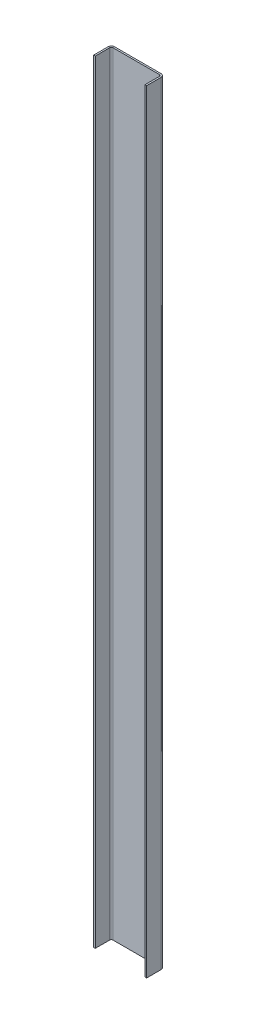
ISO-10303-21;
HEADER;
FILE_DESCRIPTION(('STEP AP214'),'2;1');
FILE_NAME('part.step','',(''),(''),'','','');
FILE_SCHEMA(('AUTOMOTIVE_DESIGN { 1 0 10303 214 1 1 1 1 }'));
ENDSEC;
DATA;
#1=APPLICATION_CONTEXT('core data for automotive mechanical design processes');
#2=APPLICATION_PROTOCOL_DEFINITION('international standard','automotive_design',2000,#1);
#3=PRODUCT_CONTEXT('',#1,'mechanical');
#4=PRODUCT('Part','Part','',(#3));
#5=PRODUCT_RELATED_PRODUCT_CATEGORY('part','',(#4));
#6=PRODUCT_DEFINITION_FORMATION('','',#4);
#7=PRODUCT_DEFINITION_CONTEXT('part definition',#1,'design');
#8=PRODUCT_DEFINITION('design','',#6,#7);
#9=PRODUCT_DEFINITION_SHAPE('','',#8);
#10=(LENGTH_UNIT() NAMED_UNIT(*) SI_UNIT(.MILLI.,.METRE.));
#11=(NAMED_UNIT(*) PLANE_ANGLE_UNIT() SI_UNIT($,.RADIAN.));
#12=(NAMED_UNIT(*) SI_UNIT($,.STERADIAN.) SOLID_ANGLE_UNIT());
#13=UNCERTAINTY_MEASURE_WITH_UNIT(LENGTH_MEASURE(1.E-05),#10,'distance_accuracy_value','');
#14=(GEOMETRIC_REPRESENTATION_CONTEXT(3) GLOBAL_UNCERTAINTY_ASSIGNED_CONTEXT((#13)) GLOBAL_UNIT_ASSIGNED_CONTEXT((#10,
#11,#12)) REPRESENTATION_CONTEXT('',''));
#15=CARTESIAN_POINT('',(0.,0.,0.));
#16=DIRECTION('',(0.,0.,1.));
#17=DIRECTION('',(1.,0.,0.));
#18=AXIS2_PLACEMENT_3D('',#15,#16,#17);
#19=CARTESIAN_POINT('',(-66.675,2222.5,0.));
#20=DIRECTION('',(0.,1.,0.));
#21=DIRECTION('',(0.,0.,1.));
#22=AXIS2_PLACEMENT_3D('',#19,#20,#21);
#23=PLANE('',#22);
#24=DIRECTION('',(0.,0.,1.));
#25=VECTOR('',#24,1.);
#26=CARTESIAN_POINT('',(-66.675,2222.5,0.));
#27=LINE('',#26,#25);
#28=CARTESIAN_POINT('',(-66.675,2222.5,0.));
#29=VERTEX_POINT('',#28);
#30=CARTESIAN_POINT('',(-66.675,2222.5,4.7625));
#31=VERTEX_POINT('',#30);
#32=EDGE_CURVE('E11',#29,#31,#27,.T.);
#33=ORIENTED_EDGE('',*,*,#32,.F.);
#34=CARTESIAN_POINT('',(-66.675,2222.5,9.525));
#35=DIRECTION('',(0.,1.,0.));
#36=DIRECTION('',(0.,0.,1.));
#37=AXIS2_PLACEMENT_3D('',#34,#35,#36);
#38=CIRCLE('',#37,9.525);
#39=CARTESIAN_POINT('',(-76.2,2222.5,9.525));
#40=VERTEX_POINT('',#39);
#41=EDGE_CURVE('E247',#40,#29,#38,.F.);
#42=ORIENTED_EDGE('',*,*,#41,.F.);
#43=DIRECTION('',(-1.,0.,0.));
#44=VECTOR('',#43,1.);
#45=CARTESIAN_POINT('',(-71.4375,2222.5,9.525));
#46=LINE('',#45,#44);
#47=CARTESIAN_POINT('',(-71.4375,2222.5,9.525));
#48=VERTEX_POINT('',#47);
#49=EDGE_CURVE('E45',#48,#40,#46,.T.);
#50=ORIENTED_EDGE('',*,*,#49,.F.);
#51=CARTESIAN_POINT('',(-66.675,2222.5,9.525));
#52=DIRECTION('',(0.,1.,0.));
#53=DIRECTION('',(1.,0.,0.));
#54=AXIS2_PLACEMENT_3D('',#51,#52,#53);
#55=CIRCLE('',#54,4.7625);
#56=EDGE_CURVE('E146',#48,#31,#55,.F.);
#57=ORIENTED_EDGE('',*,*,#56,.T.);
#58=EDGE_LOOP('',(#33,#42,#50,#57));
#59=FACE_BOUND('',#58,.T.);
#60=ADVANCED_FACE('F37',(#59),#23,.T.);
#61=CARTESIAN_POINT('',(-71.4375,2222.5,9.525));
#62=DIRECTION('',(0.,1.,0.));
#63=DIRECTION('',(0.,0.,1.));
#64=AXIS2_PLACEMENT_3D('',#61,#62,#63);
#65=PLANE('',#64);
#66=DIRECTION('',(1.,0.,0.));
#67=VECTOR('',#66,1.);
#68=CARTESIAN_POINT('',(-76.2,2222.5,0.));
#69=LINE('',#68,#67);
#70=CARTESIAN_POINT('',(66.6749999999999,2222.5,0.));
#71=VERTEX_POINT('',#70);
#72=EDGE_CURVE('E140',#29,#71,#69,.T.);
#73=ORIENTED_EDGE('',*,*,#72,.F.);
#74=ORIENTED_EDGE('',*,*,#32,.T.);
#75=DIRECTION('',(1.,0.,0.));
#76=VECTOR('',#75,1.);
#77=CARTESIAN_POINT('',(-76.2,2222.5,4.7625));
#78=LINE('',#77,#76);
#79=CARTESIAN_POINT('',(66.6749999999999,2222.5,4.7625));
#80=VERTEX_POINT('',#79);
#81=EDGE_CURVE('E137',#31,#80,#78,.T.);
#82=ORIENTED_EDGE('',*,*,#81,.T.);
#83=DIRECTION('',(0.,0.,-1.));
#84=VECTOR('',#83,1.);
#85=CARTESIAN_POINT('',(66.6749999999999,2222.5,4.7625));
#86=LINE('',#85,#84);
#87=EDGE_CURVE('E228',#80,#71,#86,.T.);
#88=ORIENTED_EDGE('',*,*,#87,.T.);
#89=EDGE_LOOP('',(#73,#74,#82,#88));
#90=FACE_BOUND('',#89,.T.);
#91=ADVANCED_FACE('F135',(#90),#65,.T.);
#92=CARTESIAN_POINT('',(-76.2,0.,9.525));
#93=DIRECTION('',(0.,-1.,0.));
#94=DIRECTION('',(0.,0.,-1.));
#95=AXIS2_PLACEMENT_3D('',#92,#93,#94);
#96=PLANE('',#95);
#97=DIRECTION('',(1.,0.,0.));
#98=VECTOR('',#97,1.);
#99=CARTESIAN_POINT('',(-76.2,0.,9.525));
#100=LINE('',#99,#98);
#101=CARTESIAN_POINT('',(-76.2,0.,9.525));
#102=VERTEX_POINT('',#101);
#103=CARTESIAN_POINT('',(-71.4375,0.,9.525));
#104=VERTEX_POINT('',#103);
#105=EDGE_CURVE('E233',#102,#104,#100,.T.);
#106=ORIENTED_EDGE('',*,*,#105,.F.);
#107=CARTESIAN_POINT('',(-66.675,0.,9.525));
#108=DIRECTION('',(0.,1.,0.));
#109=DIRECTION('',(0.,0.,1.));
#110=AXIS2_PLACEMENT_3D('',#107,#108,#109);
#111=CIRCLE('',#110,9.525);
#112=CARTESIAN_POINT('',(-66.675,0.,0.));
#113=VERTEX_POINT('',#112);
#114=EDGE_CURVE('E185',#102,#113,#111,.F.);
#115=ORIENTED_EDGE('',*,*,#114,.T.);
#116=DIRECTION('',(0.,0.,-1.));
#117=VECTOR('',#116,1.);
#118=CARTESIAN_POINT('',(-66.675,0.,4.7625));
#119=LINE('',#118,#117);
#120=CARTESIAN_POINT('',(-66.675,0.,4.7625));
#121=VERTEX_POINT('',#120);
#122=EDGE_CURVE('E231',#121,#113,#119,.T.);
#123=ORIENTED_EDGE('',*,*,#122,.F.);
#124=CARTESIAN_POINT('',(-66.675,0.,9.525));
#125=DIRECTION('',(0.,1.,0.));
#126=DIRECTION('',(1.,0.,0.));
#127=AXIS2_PLACEMENT_3D('',#124,#125,#126);
#128=CIRCLE('',#127,4.7625);
#129=EDGE_CURVE('E158',#104,#121,#128,.F.);
#130=ORIENTED_EDGE('',*,*,#129,.F.);
#131=EDGE_LOOP('',(#106,#115,#123,#130));
#132=FACE_BOUND('',#131,.T.);
#133=ADVANCED_FACE('F285',(#132),#96,.T.);
#134=CARTESIAN_POINT('',(-66.675,0.,4.7625));
#135=DIRECTION('',(0.,-1.,0.));
#136=DIRECTION('',(0.,0.,-1.));
#137=AXIS2_PLACEMENT_3D('',#134,#135,#136);
#138=PLANE('',#137);
#139=DIRECTION('',(0.,0.,-1.));
#140=VECTOR('',#139,1.);
#141=CARTESIAN_POINT('',(-76.2,0.,0.));
#142=LINE('',#141,#140);
#143=CARTESIAN_POINT('',(-76.2,0.,50.8));
#144=VERTEX_POINT('',#143);
#145=EDGE_CURVE('E188',#144,#102,#142,.T.);
#146=ORIENTED_EDGE('',*,*,#145,.T.);
#147=ORIENTED_EDGE('',*,*,#105,.T.);
#148=DIRECTION('',(0.,0.,-1.));
#149=VECTOR('',#148,1.);
#150=CARTESIAN_POINT('',(-71.4375,0.,0.));
#151=LINE('',#150,#149);
#152=CARTESIAN_POINT('',(-71.4375,0.,50.8));
#153=VERTEX_POINT('',#152);
#154=EDGE_CURVE('E194',#153,#104,#151,.T.);
#155=ORIENTED_EDGE('',*,*,#154,.F.);
#156=DIRECTION('',(-1.,0.,0.));
#157=VECTOR('',#156,1.);
#158=CARTESIAN_POINT('',(-71.4375,0.,50.8));
#159=LINE('',#158,#157);
#160=EDGE_CURVE('E191',#153,#144,#159,.T.);
#161=ORIENTED_EDGE('',*,*,#160,.T.);
#162=EDGE_LOOP('',(#146,#147,#155,#161));
#163=FACE_BOUND('',#162,.T.);
#164=ADVANCED_FACE('F288',(#163),#138,.T.);
#165=CARTESIAN_POINT('',(76.2,2222.5,9.52500000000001));
#166=DIRECTION('',(0.,1.,0.));
#167=DIRECTION('',(0.,0.,1.));
#168=AXIS2_PLACEMENT_3D('',#165,#166,#167);
#169=PLANE('',#168);
#170=DIRECTION('',(-1.,0.,0.));
#171=VECTOR('',#170,1.);
#172=CARTESIAN_POINT('',(76.2,2222.5,9.52500000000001));
#173=LINE('',#172,#171);
#174=CARTESIAN_POINT('',(76.2,2222.5,9.52500000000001));
#175=VERTEX_POINT('',#174);
#176=CARTESIAN_POINT('',(71.4375,2222.5,9.525));
#177=VERTEX_POINT('',#176);
#178=EDGE_CURVE('E53',#175,#177,#173,.T.);
#179=ORIENTED_EDGE('',*,*,#178,.F.);
#180=CARTESIAN_POINT('',(66.675,2222.5,9.525));
#181=DIRECTION('',(0.,1.,0.));
#182=DIRECTION('',(0.,0.,1.));
#183=AXIS2_PLACEMENT_3D('',#180,#181,#182);
#184=CIRCLE('',#183,9.525);
#185=EDGE_CURVE('E257',#71,#175,#184,.F.);
#186=ORIENTED_EDGE('',*,*,#185,.F.);
#187=ORIENTED_EDGE('',*,*,#87,.F.);
#188=CARTESIAN_POINT('',(66.675,2222.5,9.525));
#189=DIRECTION('',(0.,1.,0.));
#190=DIRECTION('',(1.,0.,0.));
#191=AXIS2_PLACEMENT_3D('',#188,#189,#190);
#192=CIRCLE('',#191,4.7625);
#193=EDGE_CURVE('E166',#80,#177,#192,.F.);
#194=ORIENTED_EDGE('',*,*,#193,.T.);
#195=EDGE_LOOP('',(#179,#186,#187,#194));
#196=FACE_BOUND('',#195,.T.);
#197=ADVANCED_FACE('F280',(#196),#169,.T.);
#198=CARTESIAN_POINT('',(66.6749999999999,2222.5,4.7625));
#199=DIRECTION('',(0.,1.,0.));
#200=DIRECTION('',(0.,0.,1.));
#201=AXIS2_PLACEMENT_3D('',#198,#199,#200);
#202=PLANE('',#201);
#203=DIRECTION('',(0.,0.,1.));
#204=VECTOR('',#203,1.);
#205=CARTESIAN_POINT('',(76.2,2222.5,0.));
#206=LINE('',#205,#204);
#207=CARTESIAN_POINT('',(76.2,2222.5,50.8));
#208=VERTEX_POINT('',#207);
#209=EDGE_CURVE('E260',#175,#208,#206,.T.);
#210=ORIENTED_EDGE('',*,*,#209,.F.);
#211=ORIENTED_EDGE('',*,*,#178,.T.);
#212=DIRECTION('',(0.,0.,1.));
#213=VECTOR('',#212,1.);
#214=CARTESIAN_POINT('',(71.4375,2222.5,0.));
#215=LINE('',#214,#213);
#216=CARTESIAN_POINT('',(71.4375,2222.5,50.8));
#217=VERTEX_POINT('',#216);
#218=EDGE_CURVE('E107',#177,#217,#215,.T.);
#219=ORIENTED_EDGE('',*,*,#218,.T.);
#220=DIRECTION('',(-1.,0.,0.));
#221=VECTOR('',#220,1.);
#222=CARTESIAN_POINT('',(76.2,2222.5,50.8));
#223=LINE('',#222,#221);
#224=EDGE_CURVE('E263',#208,#217,#223,.T.);
#225=ORIENTED_EDGE('',*,*,#224,.F.);
#226=EDGE_LOOP('',(#210,#211,#219,#225));
#227=FACE_BOUND('',#226,.T.);
#228=ADVANCED_FACE('F269',(#227),#202,.T.);
#229=CARTESIAN_POINT('',(66.6749999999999,0.,0.));
#230=DIRECTION('',(0.,-1.,0.));
#231=DIRECTION('',(0.,0.,-1.));
#232=AXIS2_PLACEMENT_3D('',#229,#230,#231);
#233=PLANE('',#232);
#234=DIRECTION('',(0.,0.,1.));
#235=VECTOR('',#234,1.);
#236=CARTESIAN_POINT('',(66.6749999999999,0.,0.));
#237=LINE('',#236,#235);
#238=CARTESIAN_POINT('',(66.6749999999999,0.,0.));
#239=VERTEX_POINT('',#238);
#240=CARTESIAN_POINT('',(66.6749999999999,0.,4.7625));
#241=VERTEX_POINT('',#240);
#242=EDGE_CURVE('E94',#239,#241,#237,.T.);
#243=ORIENTED_EDGE('',*,*,#242,.F.);
#244=CARTESIAN_POINT('',(66.675,0.,9.525));
#245=DIRECTION('',(0.,1.,0.));
#246=DIRECTION('',(0.,0.,1.));
#247=AXIS2_PLACEMENT_3D('',#244,#245,#246);
#248=CIRCLE('',#247,9.525);
#249=CARTESIAN_POINT('',(76.2,0.,9.52500000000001));
#250=VERTEX_POINT('',#249);
#251=EDGE_CURVE('E181',#239,#250,#248,.F.);
#252=ORIENTED_EDGE('',*,*,#251,.T.);
#253=DIRECTION('',(1.,0.,0.));
#254=VECTOR('',#253,1.);
#255=CARTESIAN_POINT('',(71.4375,0.,9.525));
#256=LINE('',#255,#254);
#257=CARTESIAN_POINT('',(71.4375,0.,9.525));
#258=VERTEX_POINT('',#257);
#259=EDGE_CURVE('E101',#258,#250,#256,.T.);
#260=ORIENTED_EDGE('',*,*,#259,.F.);
#261=CARTESIAN_POINT('',(66.675,0.,9.525));
#262=DIRECTION('',(0.,1.,0.));
#263=DIRECTION('',(1.,0.,0.));
#264=AXIS2_PLACEMENT_3D('',#261,#262,#263);
#265=CIRCLE('',#264,4.7625);
#266=EDGE_CURVE('E200',#241,#258,#265,.F.);
#267=ORIENTED_EDGE('',*,*,#266,.F.);
#268=EDGE_LOOP('',(#243,#252,#260,#267));
#269=FACE_BOUND('',#268,.T.);
#270=ADVANCED_FACE('F317',(#269),#233,.T.);
#271=CARTESIAN_POINT('',(71.4375,0.,9.525));
#272=DIRECTION('',(0.,-1.,0.));
#273=DIRECTION('',(0.,0.,-1.));
#274=AXIS2_PLACEMENT_3D('',#271,#272,#273);
#275=PLANE('',#274);
#276=DIRECTION('',(1.,0.,0.));
#277=VECTOR('',#276,1.);
#278=CARTESIAN_POINT('',(-76.2,0.,0.));
#279=LINE('',#278,#277);
#280=EDGE_CURVE('E183',#113,#239,#279,.T.);
#281=ORIENTED_EDGE('',*,*,#280,.T.);
#282=ORIENTED_EDGE('',*,*,#242,.T.);
#283=DIRECTION('',(1.,0.,0.));
#284=VECTOR('',#283,1.);
#285=CARTESIAN_POINT('',(-76.2,0.,4.7625));
#286=LINE('',#285,#284);
#287=EDGE_CURVE('E198',#121,#241,#286,.T.);
#288=ORIENTED_EDGE('',*,*,#287,.F.);
#289=ORIENTED_EDGE('',*,*,#122,.T.);
#290=EDGE_LOOP('',(#281,#282,#288,#289));
#291=FACE_BOUND('',#290,.T.);
#292=ADVANCED_FACE('F320',(#291),#275,.T.);
#293=CARTESIAN_POINT('',(71.4375,2222.5,0.));
#294=DIRECTION('',(1.,0.,0.));
#295=DIRECTION('',(0.,0.,-1.));
#296=AXIS2_PLACEMENT_3D('',#293,#294,#295);
#297=PLANE('',#296);
#298=DIRECTION('',(0.,0.,1.));
#299=VECTOR('',#298,1.);
#300=CARTESIAN_POINT('',(71.4375,0.,0.));
#301=LINE('',#300,#299);
#302=CARTESIAN_POINT('',(71.4375,0.,50.8));
#303=VERTEX_POINT('',#302);
#304=EDGE_CURVE('E172',#258,#303,#301,.T.);
#305=ORIENTED_EDGE('',*,*,#304,.T.);
#306=DIRECTION('',(0.,-1.,0.));
#307=VECTOR('',#306,1.);
#308=CARTESIAN_POINT('',(71.4375,2222.5,50.8));
#309=LINE('',#308,#307);
#310=EDGE_CURVE('E224',#217,#303,#309,.T.);
#311=ORIENTED_EDGE('',*,*,#310,.F.);
#312=ORIENTED_EDGE('',*,*,#218,.F.);
#313=DIRECTION('',(0.,-1.,0.));
#314=VECTOR('',#313,1.);
#315=CARTESIAN_POINT('',(71.4375,2222.5,9.525));
#316=LINE('',#315,#314);
#317=EDGE_CURVE('E168',#177,#258,#316,.T.);
#318=ORIENTED_EDGE('',*,*,#317,.T.);
#319=EDGE_LOOP('',(#305,#311,#312,#318));
#320=FACE_BOUND('',#319,.T.);
#321=ADVANCED_FACE('F323',(#320),#297,.F.);
#322=CARTESIAN_POINT('',(76.2,2222.5,50.8));
#323=DIRECTION('',(0.,0.,1.));
#324=DIRECTION('',(1.,0.,0.));
#325=AXIS2_PLACEMENT_3D('',#322,#323,#324);
#326=PLANE('',#325);
#327=DIRECTION('',(-1.,0.,0.));
#328=VECTOR('',#327,1.);
#329=CARTESIAN_POINT('',(76.2,0.,50.8));
#330=LINE('',#329,#328);
#331=CARTESIAN_POINT('',(76.2,0.,50.8));
#332=VERTEX_POINT('',#331);
#333=EDGE_CURVE('E175',#332,#303,#330,.T.);
#334=ORIENTED_EDGE('',*,*,#333,.F.);
#335=DIRECTION('',(0.,-1.,0.));
#336=VECTOR('',#335,1.);
#337=CARTESIAN_POINT('',(76.2,2222.5,50.8));
#338=LINE('',#337,#336);
#339=EDGE_CURVE('E222',#208,#332,#338,.T.);
#340=ORIENTED_EDGE('',*,*,#339,.F.);
#341=ORIENTED_EDGE('',*,*,#224,.T.);
#342=ORIENTED_EDGE('',*,*,#310,.T.);
#343=EDGE_LOOP('',(#334,#340,#341,#342));
#344=FACE_BOUND('',#343,.T.);
#345=ADVANCED_FACE('F268',(#344),#326,.T.);
#346=CARTESIAN_POINT('',(76.2,2222.5,0.));
#347=DIRECTION('',(1.,0.,0.));
#348=DIRECTION('',(0.,0.,-1.));
#349=AXIS2_PLACEMENT_3D('',#346,#347,#348);
#350=PLANE('',#349);
#351=DIRECTION('',(0.,0.,1.));
#352=VECTOR('',#351,1.);
#353=CARTESIAN_POINT('',(76.2,0.,0.));
#354=LINE('',#353,#352);
#355=EDGE_CURVE('E178',#250,#332,#354,.T.);
#356=ORIENTED_EDGE('',*,*,#355,.F.);
#357=DIRECTION('',(0.,-1.,0.));
#358=VECTOR('',#357,1.);
#359=CARTESIAN_POINT('',(76.2,2222.5,9.52500000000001));
#360=LINE('',#359,#358);
#361=EDGE_CURVE('E219',#175,#250,#360,.T.);
#362=ORIENTED_EDGE('',*,*,#361,.F.);
#363=ORIENTED_EDGE('',*,*,#209,.T.);
#364=ORIENTED_EDGE('',*,*,#339,.T.);
#365=EDGE_LOOP('',(#356,#362,#363,#364));
#366=FACE_BOUND('',#365,.T.);
#367=ADVANCED_FACE('F273',(#366),#350,.T.);
#368=CARTESIAN_POINT('',(66.675,2222.5,9.525));
#369=DIRECTION('',(0.,-1.,0.));
#370=DIRECTION('',(0.,0.,-1.));
#371=AXIS2_PLACEMENT_3D('',#368,#369,#370);
#372=CYLINDRICAL_SURFACE('',#371,9.525);
#373=ORIENTED_EDGE('',*,*,#251,.F.);
#374=DIRECTION('',(0.,-1.,0.));
#375=VECTOR('',#374,1.);
#376=CARTESIAN_POINT('',(66.6749999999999,2222.5,0.));
#377=LINE('',#376,#375);
#378=EDGE_CURVE('E216',#71,#239,#377,.T.);
#379=ORIENTED_EDGE('',*,*,#378,.F.);
#380=ORIENTED_EDGE('',*,*,#185,.T.);
#381=ORIENTED_EDGE('',*,*,#361,.T.);
#382=EDGE_LOOP('',(#373,#379,#380,#381));
#383=FACE_BOUND('',#382,.T.);
#384=ADVANCED_FACE('F276',(#383),#372,.T.);
#385=CARTESIAN_POINT('',(-76.2,2222.5,0.));
#386=DIRECTION('',(0.,0.,-1.));
#387=DIRECTION('',(-1.,0.,0.));
#388=AXIS2_PLACEMENT_3D('',#385,#386,#387);
#389=PLANE('',#388);
#390=ORIENTED_EDGE('',*,*,#280,.F.);
#391=DIRECTION('',(0.,-1.,0.));
#392=VECTOR('',#391,1.);
#393=CARTESIAN_POINT('',(-66.675,2222.5,0.));
#394=LINE('',#393,#392);
#395=EDGE_CURVE('E213',#29,#113,#394,.T.);
#396=ORIENTED_EDGE('',*,*,#395,.F.);
#397=ORIENTED_EDGE('',*,*,#72,.T.);
#398=ORIENTED_EDGE('',*,*,#378,.T.);
#399=EDGE_LOOP('',(#390,#396,#397,#398));
#400=FACE_BOUND('',#399,.T.);
#401=ADVANCED_FACE('F283',(#400),#389,.T.);
#402=CARTESIAN_POINT('',(-66.675,2222.5,9.525));
#403=DIRECTION('',(0.,-1.,0.));
#404=DIRECTION('',(0.,0.,-1.));
#405=AXIS2_PLACEMENT_3D('',#402,#403,#404);
#406=CYLINDRICAL_SURFACE('',#405,9.525);
#407=ORIENTED_EDGE('',*,*,#114,.F.);
#408=DIRECTION('',(0.,-1.,0.));
#409=VECTOR('',#408,1.);
#410=CARTESIAN_POINT('',(-76.2,2222.5,9.525));
#411=LINE('',#410,#409);
#412=EDGE_CURVE('E210',#40,#102,#411,.T.);
#413=ORIENTED_EDGE('',*,*,#412,.F.);
#414=ORIENTED_EDGE('',*,*,#41,.T.);
#415=ORIENTED_EDGE('',*,*,#395,.T.);
#416=EDGE_LOOP('',(#407,#413,#414,#415));
#417=FACE_BOUND('',#416,.T.);
#418=ADVANCED_FACE('F246',(#417),#406,.T.);
#419=CARTESIAN_POINT('',(-76.2,2222.5,0.));
#420=DIRECTION('',(-1.,0.,0.));
#421=DIRECTION('',(0.,0.,1.));
#422=AXIS2_PLACEMENT_3D('',#419,#420,#421);
#423=PLANE('',#422);
#424=ORIENTED_EDGE('',*,*,#145,.F.);
#425=DIRECTION('',(0.,-1.,0.));
#426=VECTOR('',#425,1.);
#427=CARTESIAN_POINT('',(-76.2,2222.5,50.8));
#428=LINE('',#427,#426);
#429=CARTESIAN_POINT('',(-76.2,2222.5,50.8));
#430=VERTEX_POINT('',#429);
#431=EDGE_CURVE('E208',#430,#144,#428,.T.);
#432=ORIENTED_EDGE('',*,*,#431,.F.);
#433=DIRECTION('',(0.,0.,-1.));
#434=VECTOR('',#433,1.);
#435=CARTESIAN_POINT('',(-76.2,2222.5,0.));
#436=LINE('',#435,#434);
#437=EDGE_CURVE('E240',#430,#40,#436,.T.);
#438=ORIENTED_EDGE('',*,*,#437,.T.);
#439=ORIENTED_EDGE('',*,*,#412,.T.);
#440=EDGE_LOOP('',(#424,#432,#438,#439));
#441=FACE_BOUND('',#440,.T.);
#442=ADVANCED_FACE('F251',(#441),#423,.T.);
#443=CARTESIAN_POINT('',(-71.4375,2222.5,50.8));
#444=DIRECTION('',(0.,0.,1.));
#445=DIRECTION('',(1.,0.,0.));
#446=AXIS2_PLACEMENT_3D('',#443,#444,#445);
#447=PLANE('',#446);
#448=ORIENTED_EDGE('',*,*,#160,.F.);
#449=DIRECTION('',(0.,-1.,0.));
#450=VECTOR('',#449,1.);
#451=CARTESIAN_POINT('',(-71.4375,2222.5,50.8));
#452=LINE('',#451,#450);
#453=CARTESIAN_POINT('',(-71.4375,2222.5,50.8));
#454=VERTEX_POINT('',#453);
#455=EDGE_CURVE('E206',#454,#153,#452,.T.);
#456=ORIENTED_EDGE('',*,*,#455,.F.);
#457=DIRECTION('',(-1.,0.,0.));
#458=VECTOR('',#457,1.);
#459=CARTESIAN_POINT('',(-71.4375,2222.5,50.8));
#460=LINE('',#459,#458);
#461=EDGE_CURVE('E252',#454,#430,#460,.T.);
#462=ORIENTED_EDGE('',*,*,#461,.T.);
#463=ORIENTED_EDGE('',*,*,#431,.T.);
#464=EDGE_LOOP('',(#448,#456,#462,#463));
#465=FACE_BOUND('',#464,.T.);
#466=ADVANCED_FACE('F293',(#465),#447,.T.);
#467=CARTESIAN_POINT('',(-71.4375,2222.5,0.));
#468=DIRECTION('',(-1.,0.,0.));
#469=DIRECTION('',(0.,0.,1.));
#470=AXIS2_PLACEMENT_3D('',#467,#468,#469);
#471=PLANE('',#470);
#472=ORIENTED_EDGE('',*,*,#154,.T.);
#473=DIRECTION('',(0.,-1.,0.));
#474=VECTOR('',#473,1.);
#475=CARTESIAN_POINT('',(-71.4375,2222.5,9.525));
#476=LINE('',#475,#474);
#477=EDGE_CURVE('E160',#48,#104,#476,.T.);
#478=ORIENTED_EDGE('',*,*,#477,.F.);
#479=DIRECTION('',(0.,0.,-1.));
#480=VECTOR('',#479,1.);
#481=CARTESIAN_POINT('',(-71.4375,2222.5,0.));
#482=LINE('',#481,#480);
#483=EDGE_CURVE('E151',#454,#48,#482,.T.);
#484=ORIENTED_EDGE('',*,*,#483,.F.);
#485=ORIENTED_EDGE('',*,*,#455,.T.);
#486=EDGE_LOOP('',(#472,#478,#484,#485));
#487=FACE_BOUND('',#486,.T.);
#488=ADVANCED_FACE('F291',(#487),#471,.F.);
#489=CARTESIAN_POINT('',(-66.675,2222.5,9.525));
#490=DIRECTION('',(0.,-1.,0.));
#491=DIRECTION('',(0.,0.,-1.));
#492=AXIS2_PLACEMENT_3D('',#489,#490,#491);
#493=CYLINDRICAL_SURFACE('',#492,4.7625);
#494=ORIENTED_EDGE('',*,*,#129,.T.);
#495=DIRECTION('',(0.,-1.,0.));
#496=VECTOR('',#495,1.);
#497=CARTESIAN_POINT('',(-66.675,2222.5,4.7625));
#498=LINE('',#497,#496);
#499=EDGE_CURVE('E155',#31,#121,#498,.T.);
#500=ORIENTED_EDGE('',*,*,#499,.F.);
#501=ORIENTED_EDGE('',*,*,#56,.F.);
#502=ORIENTED_EDGE('',*,*,#477,.T.);
#503=EDGE_LOOP('',(#494,#500,#501,#502));
#504=FACE_BOUND('',#503,.T.);
#505=ADVANCED_FACE('F156',(#504),#493,.F.);
#506=CARTESIAN_POINT('',(-76.2,2222.5,4.7625));
#507=DIRECTION('',(0.,0.,-1.));
#508=DIRECTION('',(-1.,0.,0.));
#509=AXIS2_PLACEMENT_3D('',#506,#507,#508);
#510=PLANE('',#509);
#511=ORIENTED_EDGE('',*,*,#287,.T.);
#512=DIRECTION('',(0.,-1.,0.));
#513=VECTOR('',#512,1.);
#514=CARTESIAN_POINT('',(66.6749999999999,2222.5,4.7625));
#515=LINE('',#514,#513);
#516=EDGE_CURVE('E161',#80,#241,#515,.T.);
#517=ORIENTED_EDGE('',*,*,#516,.F.);
#518=ORIENTED_EDGE('',*,*,#81,.F.);
#519=ORIENTED_EDGE('',*,*,#499,.T.);
#520=EDGE_LOOP('',(#511,#517,#518,#519));
#521=FACE_BOUND('',#520,.T.);
#522=ADVANCED_FACE('F163',(#521),#510,.F.);
#523=CARTESIAN_POINT('',(66.675,2222.5,9.525));
#524=DIRECTION('',(0.,-1.,0.));
#525=DIRECTION('',(0.,0.,-1.));
#526=AXIS2_PLACEMENT_3D('',#523,#524,#525);
#527=CYLINDRICAL_SURFACE('',#526,4.7625);
#528=ORIENTED_EDGE('',*,*,#266,.T.);
#529=ORIENTED_EDGE('',*,*,#317,.F.);
#530=ORIENTED_EDGE('',*,*,#193,.F.);
#531=ORIENTED_EDGE('',*,*,#516,.T.);
#532=EDGE_LOOP('',(#528,#529,#530,#531));
#533=FACE_BOUND('',#532,.T.);
#534=ADVANCED_FACE('F375',(#533),#527,.F.);
#535=CARTESIAN_POINT('',(66.675,2222.5,9.525));
#536=DIRECTION('',(0.,1.,0.));
#537=DIRECTION('',(1.,0.,0.));
#538=AXIS2_PLACEMENT_3D('',#535,#536,#537);
#539=PLANE('',#538);
#540=ORIENTED_EDGE('',*,*,#483,.T.);
#541=ORIENTED_EDGE('',*,*,#49,.T.);
#542=ORIENTED_EDGE('',*,*,#437,.F.);
#543=ORIENTED_EDGE('',*,*,#461,.F.);
#544=EDGE_LOOP('',(#540,#541,#542,#543));
#545=FACE_BOUND('',#544,.T.);
#546=ADVANCED_FACE('F237',(#545),#539,.T.);
#547=CARTESIAN_POINT('',(66.675,0.,9.525));
#548=DIRECTION('',(0.,1.,0.));
#549=DIRECTION('',(1.,0.,0.));
#550=AXIS2_PLACEMENT_3D('',#547,#548,#549);
#551=PLANE('',#550);
#552=ORIENTED_EDGE('',*,*,#304,.F.);
#553=ORIENTED_EDGE('',*,*,#259,.T.);
#554=ORIENTED_EDGE('',*,*,#355,.T.);
#555=ORIENTED_EDGE('',*,*,#333,.T.);
#556=EDGE_LOOP('',(#552,#553,#554,#555));
#557=FACE_BOUND('',#556,.T.);
#558=ADVANCED_FACE('F395',(#557),#551,.F.);
#559=CLOSED_SHELL('',(#60,#91,#133,#164,#197,#228,#270,#292,#321,#345,#367,#384,#401,#418,#442,
#466,#488,#505,#522,#534,#546,#558));
#560=MANIFOLD_SOLID_BREP('B2',#559);
#561=ADVANCED_BREP_SHAPE_REPRESENTATION('',(#18,#560),#14);
#562=SHAPE_DEFINITION_REPRESENTATION(#9,#561);
ENDSEC;
END-ISO-10303-21;
